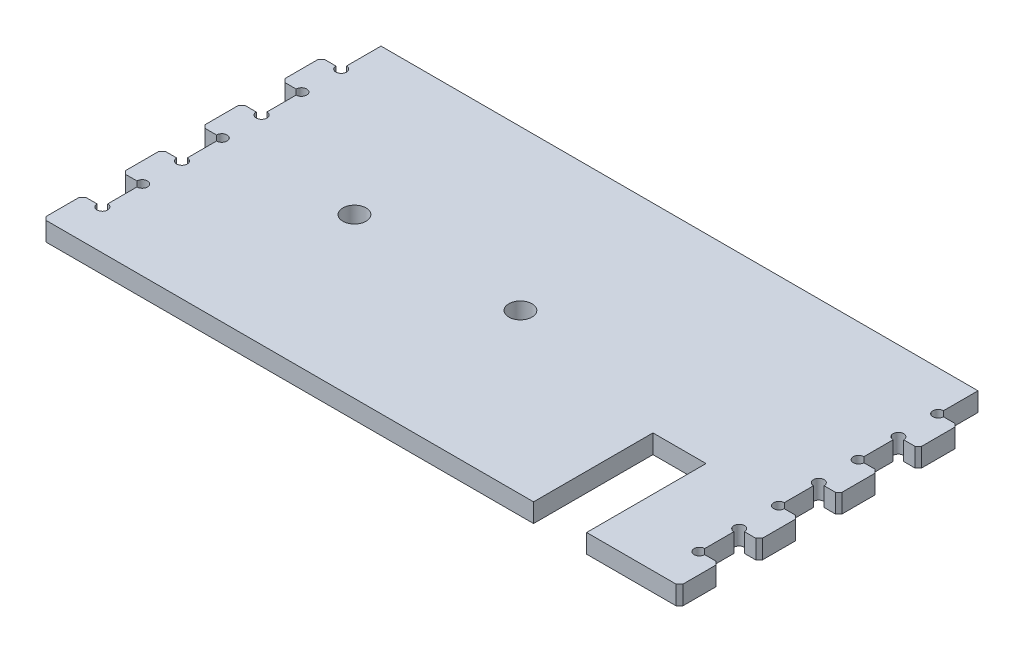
from build123d import *

# Parameters (mm, degrees)
PANEL_W                = 571.5
PANEL_H                = 304.8
PANEL_R                = 11.1125
PANELX_DEPTH           = 18.034
TABS_W                 = 19.05
TABS_H                 = 38.1
TABSX_DEPTH            = 18.034
PRESSFIT_SIZE          = 3.175
SHOPBOTCONSIDERATION_R = 5.08
SBCONSIDERATION_DEPTH  = 18.034
CUT_EXTRUDE1_REACH     = 666.814
DRAIN_CUTAWAY_W        = 50.8
DRAIN_CUTAWAY_H        = 114.3


with BuildPart() as part:
    # panel → panelx (new body)
    with BuildSketch(Plane(origin=(0, 0, 0), x_dir=(1, 0, 0), z_dir=(0, 1, 0))):
        with Locations((285.75, 152.4)):
            Rectangle(PANEL_W, PANEL_H)
        with Locations(Location((127, 152.4, 0), (0, 0, 270))):
            Circle(PANEL_R, mode=Mode.SUBTRACT)
        with Locations(Location((285.877, 152.4, 0), (0, 0, 270))):
            Circle(PANEL_R, mode=Mode.SUBTRACT)
    extrude(amount=PANELX_DEPTH)

    # tabs → tabsx (add)
    with BuildSketch(Plane(origin=(0, 18.034, 0), x_dir=(1, 0, 0), z_dir=(0, 1, 0))):
        with Locations((-9.525, 19.05)):
            Rectangle(TABS_W, TABS_H)
        with Locations((581.025, 19.05)):
            Rectangle(TABS_W, TABS_H)
        with Locations((-9.525, 95.25)):
            Rectangle(TABS_W, TABS_H)
        with Locations((581.025, 95.25)):
            Rectangle(TABS_W, TABS_H)
        with Locations((-9.525, 171.45)):
            Rectangle(TABS_W, TABS_H)
        with Locations((581.025, 171.45)):
            Rectangle(TABS_W, TABS_H)
        with Locations((-9.525, 247.65)):
            Rectangle(TABS_W, TABS_H)
        with Locations((581.025, 247.65)):
            Rectangle(TABS_W, TABS_H)
    extrude(amount=-TABSX_DEPTH)

    # pressfit
    pressfit_edges = [part.edges().sort_by_distance(p)[0] for p in [
        (-19.05, 9.017, -38.1),
        (-19.05, 9.017, 0),
        (590.55, 9.017, -38.1),
        (590.55, 9.017, 0),
        (-19.05, 9.017, -114.3),
        (-19.05, 9.017, -76.2),
        (590.55, 9.017, -114.3),
        (590.55, 9.017, -76.2),
        (-19.05, 9.017, -190.5),
        (-19.05, 9.017, -152.4),
        (590.55, 9.017, -190.5),
        (590.55, 9.017, -152.4),
        (-19.05, 9.017, -266.7),
        (-19.05, 9.017, -228.6),
        (590.55, 9.017, -266.7),
        (590.55, 9.017, -228.6),
    ]]
    chamfer(pressfit_edges, length=PRESSFIT_SIZE)

    # shopbotconsideration → SBconsideration (cut)
    with BuildSketch(Plane(origin=(0, 18.034, 0), x_dir=(1, 0, 0), z_dir=(0, 1, 0))):
        with Locations((0, 266.7)):
            Circle(SHOPBOTCONSIDERATION_R)
        with Locations((571.5, 266.7)):
            Circle(SHOPBOTCONSIDERATION_R)
        with Locations((571.5, 228.6)):
            Circle(SHOPBOTCONSIDERATION_R)
        with Locations((571.5, 190.5)):
            Circle(SHOPBOTCONSIDERATION_R)
        with Locations((571.5, 152.4)):
            Circle(SHOPBOTCONSIDERATION_R)
        with Locations((571.5, 114.3)):
            Circle(SHOPBOTCONSIDERATION_R)
        with Locations((571.5, 76.2)):
            Circle(SHOPBOTCONSIDERATION_R)
        with Locations((571.5, 38.1)):
            Circle(SHOPBOTCONSIDERATION_R)
        with Locations((0, 228.6)):
            Circle(SHOPBOTCONSIDERATION_R)
        with Locations((0, 190.5)):
            Circle(SHOPBOTCONSIDERATION_R)
        with Locations((0, 152.4)):
            Circle(SHOPBOTCONSIDERATION_R)
        with Locations((0, 114.3)):
            Circle(SHOPBOTCONSIDERATION_R)
        with Locations((0, 76.2)):
            Circle(SHOPBOTCONSIDERATION_R)
        with Locations((0, 38.1)):
            Circle(SHOPBOTCONSIDERATION_R)
    extrude(amount=-SBCONSIDERATION_DEPTH, mode=Mode.SUBTRACT)

    # drain cutaway → Cut-Extrude1 (cut, up to next)
    with BuildSketch(Plane(origin=(0, 18.034, 0), x_dir=(1, 0, 0), z_dir=(0, 1, 0)), mode=Mode.PRIVATE) as cut_extrude1_sk1:
        with Locations((476.25, 57.15)):
            Rectangle(DRAIN_CUTAWAY_W, DRAIN_CUTAWAY_H)
    cut_extrude1_tool1 = extrude(cut_extrude1_sk1.sketch, amount=-CUT_EXTRUDE1_REACH, mode=Mode.PRIVATE) & part.part
    add(cut_extrude1_tool1.solids().sort_by_distance((476.25, 18.034, -57.15))[0], mode=Mode.SUBTRACT)


solid = part.part
